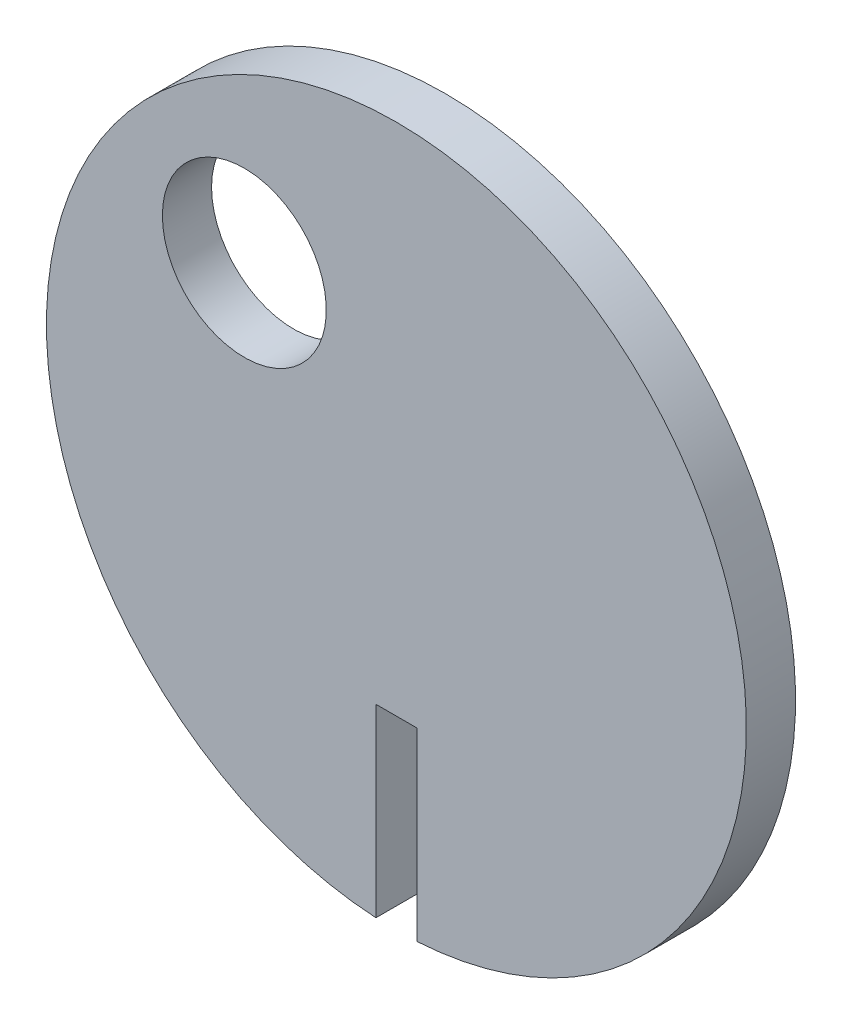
from build123d import *

# Parameters (mm, degrees)
SKETCH1_R          = 27.1145
EXTRUDE1_DEPTH     = 3.81
SKETCH2_R          = 6.35
SKETCH2_W          = 3.175
SKETCH2_H          = 17.097271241
CUT_EXTRUDE1_DEPTH = 39.534508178


with BuildPart() as part:
    # Sketch1 → Extrude1 (new body)
    with BuildSketch(Plane.XY):
        with Locations(Location((0, 0, 0), (0, 0, 180))):
            Circle(SKETCH1_R)
    extrude(amount=EXTRUDE1_DEPTH)

    # Sketch2 → Cut-Extrude1 (cut, through all)
    with BuildSketch(Plane.XY):
        with Locations(Location((-11.782096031, 11.782096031, 0), (0, 0, 180))):
            Circle(SKETCH2_R)
        with Locations((0, -21.291695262)):
            Rectangle(SKETCH2_W, SKETCH2_H)
    extrude(amount=CUT_EXTRUDE1_DEPTH, mode=Mode.SUBTRACT)


solid = part.part
